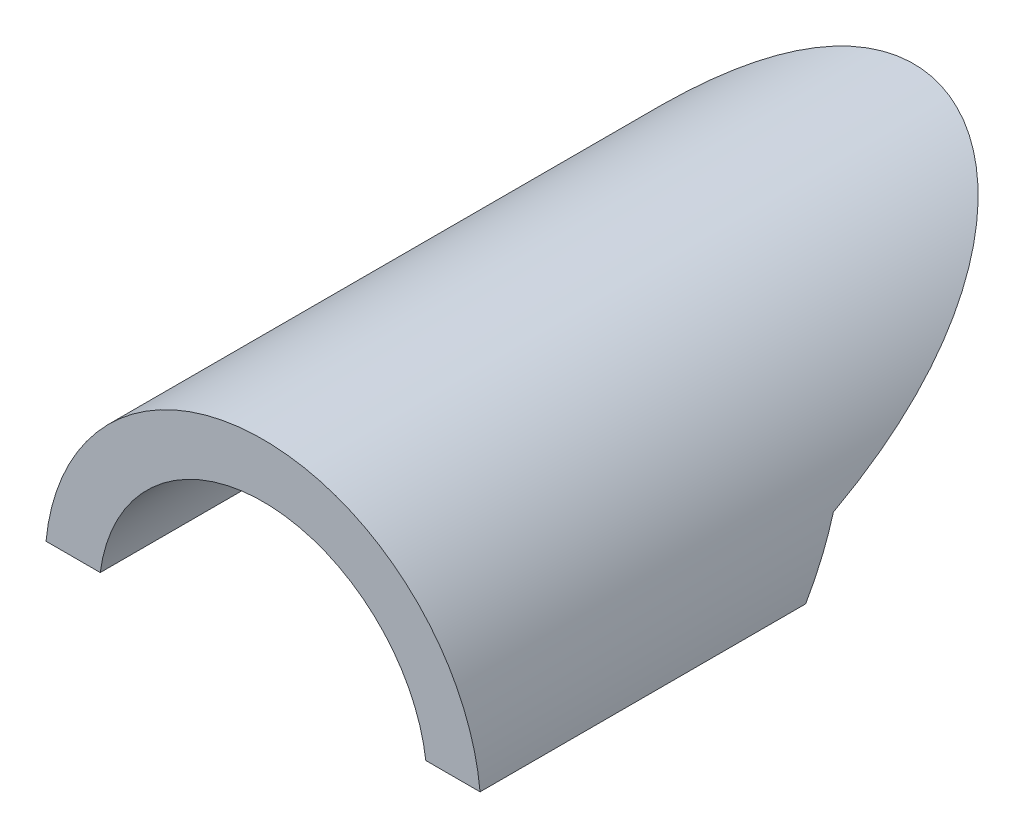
from build123d import *

# Parameters (mm, degrees)
BOSS_EXTRUDE2_DEPTH = 304.8
SKETCH3_W           = 13.845200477
SKETCH3_H           = 11.908668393
BOSS_EXTRUDE3_DEPTH = 6.35
CUT_EXTRUDE1_DEPTH  = 228.6


with BuildPart() as part:
    # Sketch2 → Boss-Extrude2 (new body)
    with BuildSketch(Plane.XY):
        with BuildLine():
            Line((0, 0), (25.4, 0))
            ThreePointArc((25.4, 0), (101.6, 66.864305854), (177.8, 0))
            Line((177.8, 0), (203.2, 0))
            ThreePointArc((203.2, 0), (101.6, 92.102283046), (0, 0))
        make_face()
    extrude(amount=BOSS_EXTRUDE2_DEPTH)

    # Sketch3 → Boss-Extrude3 (add)
    with BuildSketch(Plane(origin=(0, 0, 0), x_dir=(-1, 0, 0), z_dir=(0, 0, -1))):
        with Locations((-196.277399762, 5.954334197)):
            Rectangle(SKETCH3_W, SKETCH3_H)
    extrude(amount=BOSS_EXTRUDE3_DEPTH)

    # Sketch4 → Cut-Extrude1 (cut)
    with BuildSketch(Plane(origin=(203.2, 0, 0), x_dir=(0, 0, -1), z_dir=(1, 0, 0))):
        with BuildLine():
            Line((-152.4, 0), (24.845348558, -50.647197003))
            Line((24.845348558, -50.647197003), (27.767022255, 49.959044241))
            Line((27.767022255, 49.959044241), (0, 92.263471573))
            ThreePointArc((0, 92.263471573), (-64.578711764, 54.107415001), (-133.720245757, 25.025755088))
            Line((-133.720245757, 25.025755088), (-152.4, 0))
        make_face()
    extrude(amount=-CUT_EXTRUDE1_DEPTH, mode=Mode.SUBTRACT)


solid = part.part
